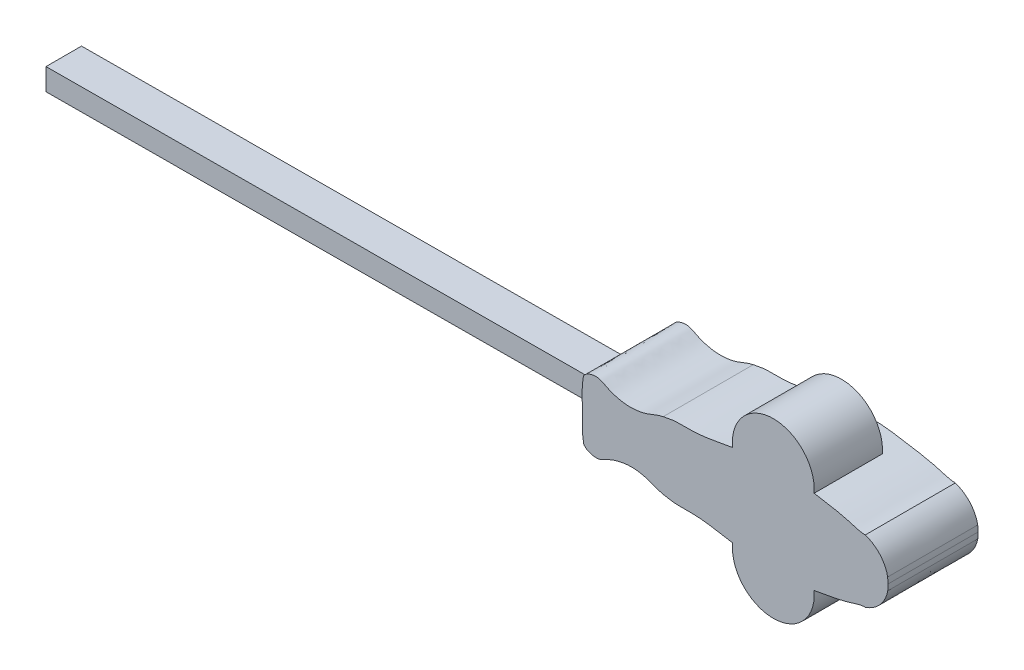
from build123d import *

# Parameters (mm, degrees)
BOSS_EXTRU_1_DEPTH      = 16.5
BOSS_EXTRU_1_DEPTH_BACK = 16.5
BOSS_EXTRU_2_DEPTH      = 204
BOSS_EXTRU_2_DEPTH_BACK = 5
BOSS_EXTRU_3_DEPTH      = 25


with BuildPart() as part:
    # Esquisse1 → Boss.-Extru.1 (new, two sides: drawn at the far end of the back side and taken through both)
    with BuildSketch(Plane.XY.offset(-BOSS_EXTRU_1_DEPTH_BACK)):
        with BuildLine():
            add(Edge.make_bspline(
                [(-0.032865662, 3.401267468), (-0.224843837, 7.162553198), (0.44023693, 10.882257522)],
                knots=[0, 0, 0, 1, 1, 1], degree=2))
            add(Edge.make_bspline(
                [(0.44023693, 10.882257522), (1.254584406, 11.987068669), (3.198474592, 12.861745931), (6.069460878, 12.983670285), (8.102063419, 11.964714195), (10.410042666, 10.775554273), (13.186119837, 9.936569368), (16.542055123, 9.383749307), (20.171862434, 9.521311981), (24.057507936, 10.396311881), (27.077643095, 11.82091293), (29.045388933, 12.34115857), (29.658579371, 12.493288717)],
                knots=[0, 0, 0, 0, 0.120356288, 0.182103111, 0.252493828, 0.320379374, 0.416926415, 0.511670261, 0.625759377, 0.741661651, 0.867963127, 0.924773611, 0.924773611, 0.924773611, 0.924773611], degree=3))
            add(Edge.make_bspline(
                [(29.658579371, 12.493288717), (31.012865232, 12.750604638), (33.041458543, 13.211022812), (36.261256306, 13.256079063), (39.045258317, 13.257764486), (42.498505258, 13.390363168), (46.086926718, 13.792913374), (49.779062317, 14.488436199), (53.47784415, 15.15791922), (57.116896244, 15.727044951), (60.965789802, 16.271065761), (64.982894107, 16.626263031), (69.110135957, 17.089949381), (73.445124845, 17.062569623), (77.623582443, 16.967008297), (81.836310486, 16.32307468), (86.166989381, 15.637259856), (91.709301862, 14.738317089), (97.625170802, 13.482934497), (101.818778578, 11.944720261), (103.707407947, 11.990805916)],
                knots=[0, 0, 0, 0, 0.055398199, 0.08267741, 0.128818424, 0.167035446, 0.221096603, 0.273333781, 0.317568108, 0.371733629, 0.42094103, 0.473294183, 0.533363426, 0.587167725, 0.646878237, 0.700631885, 0.757710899, 0.822668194, 0.925588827, 1, 1, 1, 1], degree=3))
            add(Edge.make_bspline(
                [(103.707407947, 11.990805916), (105.281267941, 11.413367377), (109.12557011, 9.281811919), (111.416904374, 5.307594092), (111.901090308, 2.7335571)],
                knots=[0, 0, 0, 0, 0.390825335, 1, 1, 1, 1], degree=3))
            add(Edge.make_bspline(
                [(112, 0.541102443), (111.994702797, 1.637543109), (111.901090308, 2.7335571)],
                knots=[0.5, 0.5, 0.5, 1, 1, 1], degree=2))
            Line((112, 0.541102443), (0, 0))
            Line((0, 0), (-0.032865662, 3.401267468))
        make_face()
        with BuildLine():
            add(Edge.make_bspline(
                [(112, 0.541102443), (112.005297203, -0.555338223), (111.92227912, -1.652205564)],
                knots=[0.5, 0.5, 0.5, 1, 1, 1], degree=2))
            add(Edge.make_bspline(
                [(103.818425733, -10.988192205), (105.386632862, -10.395573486), (109.210159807, -8.226972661), (111.462986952, -4.230800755), (111.92227912, -1.652205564)],
                knots=[0, 0, 0, 0, 0.390825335, 1, 1, 1, 1], degree=3))
            add(Edge.make_bspline(
                [(29.777909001, -12.206134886), (31.13461791, -12.450353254), (33.16756523, -12.891149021), (36.387648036, -12.905092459), (39.171536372, -12.879877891), (42.625903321, -12.979104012), (46.218046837, -13.346962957), (49.916730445, -14.006778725), (53.621808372, -14.640491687), (57.266189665, -15.174429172), (61.120160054, -15.681235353), (65.140508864, -15.997601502), (69.272038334, -16.421387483), (73.606560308, -16.352122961), (77.783899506, -16.21619251), (81.990209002, -15.531584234), (86.314059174, -14.803957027), (91.847427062, -13.851504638), (97.750889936, -12.539019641), (101.929439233, -10.960357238), (103.818425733, -10.988192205)],
                knots=[0, 0, 0, 0, 0.055398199, 0.08267741, 0.128818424, 0.167035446, 0.221096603, 0.273333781, 0.317568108, 0.371733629, 0.42094103, 0.473294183, 0.533363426, 0.587167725, 0.646878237, 0.700631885, 0.757710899, 0.822668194, 0.925588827, 1, 1, 1, 1], degree=3))
            add(Edge.make_bspline(
                [(0.545364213, -10.877495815), (1.370348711, -11.974386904), (3.322599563, -12.830240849), (6.1946299, -12.924419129), (8.217292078, -11.885870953), (10.513673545, -10.674466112), (13.281514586, -9.808697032), (16.63195169, -9.223476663), (20.26291873, -9.325960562), (24.156837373, -10.163375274), (27.190596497, -11.558728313), (29.163277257, -12.059936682), (29.777909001, -12.206134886)],
                knots=[0, 0, 0, 0, 0.120356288, 0.182103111, 0.252493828, 0.320379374, 0.416926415, 0.511670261, 0.625759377, 0.741661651, 0.867963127, 0.924773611, 0.924773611, 0.924773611, 0.924773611], degree=3))
            add(Edge.make_bspline(
                [(0, -3.401426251), (-0.155626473, -7.164391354), (0.545364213, -10.877495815)],
                knots=[0, 0, 0, 1, 1, 1], degree=2))
            Line((0, -3.401426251), (0, 0))
            Line((0, 0), (112, 0.541102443))
        make_face()
    extrude(amount=BOSS_EXTRU_1_DEPTH + BOSS_EXTRU_1_DEPTH_BACK)

    # Esquisse2 → Boss.-Extru.2 (add, two sides: drawn at the far end of the back side and taken through both)
    with BuildSketch(Plane(origin=(0, 0, 0), x_dir=(0, 0, 1), z_dir=(-0.9999883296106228, -0.004831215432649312, 0)).offset(-BOSS_EXTRU_2_DEPTH_BACK)):
        Polygon((0, 4), (9.016140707, 4), (9.016140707, -4), (0.517945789, -4), (-4, -4), (-4, 4), align=None)
    extrude(amount=BOSS_EXTRU_2_DEPTH + BOSS_EXTRU_2_DEPTH_BACK)

    # Esquisse3 → Boss.-Extru.3 (add)
    with BuildSketch(Plane.XY.offset(16.5)):
        with BuildLine():
            ThreePointArc((84.950754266, 15.828711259), (69.787759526, 32.041683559), (55.08959678, 15.406152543))
            add(Edge.make_bspline(
                [(55.08959678, 15.406152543), (55.806064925, 15.519773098), (57.737109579, 15.814708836), (60.965789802, 16.271065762), (64.982894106, 16.626263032), (69.110135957, 17.089949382), (73.445124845, 17.062569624), (77.623582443, 16.967008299), (81.49467982, 16.3752944), (83.885189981, 15.998375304), (84.950754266, 15.828711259)],
                knots=[0.342661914, 0.342661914, 0.342661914, 0.342661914, 0.371733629, 0.42094103, 0.473294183, 0.533363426, 0.587167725, 0.646878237, 0.700631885, 0.743880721, 0.743880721, 0.743880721, 0.743880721], degree=3))
        make_face()
        with BuildLine():
            ThreePointArc((55.076493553, -14.849370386), (69.907280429, -31.362013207), (84.941069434, -15.033975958))
            add(Edge.make_bspline(
                [(55.076493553, -14.849370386), (55.847054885, -14.96462114), (57.833943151, -15.249090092), (61.120160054, -15.681235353), (65.140508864, -15.997601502), (69.272038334, -16.421387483), (73.606560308, -16.352122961), (77.783899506, -16.21619251), (81.596072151, -15.595732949), (83.930053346, -15.204828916), (84.941069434, -15.033975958)],
                knots=[0.340509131, 0.340509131, 0.340509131, 0.340509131, 0.371733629, 0.42094103, 0.473294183, 0.533363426, 0.587167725, 0.646878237, 0.700631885, 0.741730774, 0.741730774, 0.741730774, 0.741730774], degree=3))
        make_face()
    extrude(amount=-BOSS_EXTRU_3_DEPTH)


solid = part.part
